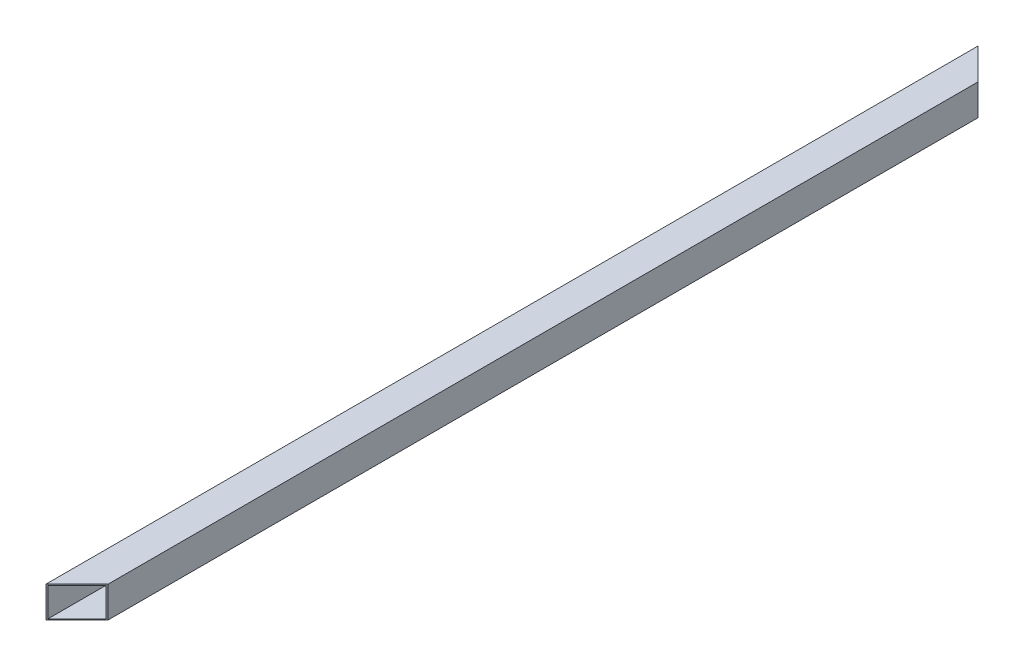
ISO-10303-21;
HEADER;
FILE_DESCRIPTION(('STEP AP214'),'2;1');
FILE_NAME('part.step','',(''),(''),'','','');
FILE_SCHEMA(('AUTOMOTIVE_DESIGN { 1 0 10303 214 1 1 1 1 }'));
ENDSEC;
DATA;
#1=APPLICATION_CONTEXT('core data for automotive mechanical design processes');
#2=APPLICATION_PROTOCOL_DEFINITION('international standard','automotive_design',2000,#1);
#3=PRODUCT_CONTEXT('',#1,'mechanical');
#4=PRODUCT('Part','Part','',(#3));
#5=PRODUCT_RELATED_PRODUCT_CATEGORY('part','',(#4));
#6=PRODUCT_DEFINITION_FORMATION('','',#4);
#7=PRODUCT_DEFINITION_CONTEXT('part definition',#1,'design');
#8=PRODUCT_DEFINITION('design','',#6,#7);
#9=PRODUCT_DEFINITION_SHAPE('','',#8);
#10=(LENGTH_UNIT() NAMED_UNIT(*) SI_UNIT(.MILLI.,.METRE.));
#11=(NAMED_UNIT(*) PLANE_ANGLE_UNIT() SI_UNIT($,.RADIAN.));
#12=(NAMED_UNIT(*) SI_UNIT($,.STERADIAN.) SOLID_ANGLE_UNIT());
#13=UNCERTAINTY_MEASURE_WITH_UNIT(LENGTH_MEASURE(1.E-05),#10,'distance_accuracy_value','');
#14=(GEOMETRIC_REPRESENTATION_CONTEXT(3) GLOBAL_UNCERTAINTY_ASSIGNED_CONTEXT((#13)) GLOBAL_UNIT_ASSIGNED_CONTEXT((#10,
#11,#12)) REPRESENTATION_CONTEXT('',''));
#15=CARTESIAN_POINT('',(0.,0.,0.));
#16=DIRECTION('',(0.,0.,1.));
#17=DIRECTION('',(1.,0.,0.));
#18=AXIS2_PLACEMENT_3D('',#15,#16,#17);
#19=CARTESIAN_POINT('',(15.0000000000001,-15.,900.000000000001));
#20=DIRECTION('',(-1.,0.,0.));
#21=DIRECTION('',(0.,0.,1.));
#22=AXIS2_PLACEMENT_3D('',#19,#20,#21);
#23=PLANE('',#22);
#24=DIRECTION('',(0.,1.,0.));
#25=VECTOR('',#24,1.);
#26=CARTESIAN_POINT('',(15.0000000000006,-15.001,870.000000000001));
#27=LINE('',#26,#25);
#28=CARTESIAN_POINT('',(15.0000000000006,-15.,870.000000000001));
#29=VERTEX_POINT('',#28);
#30=CARTESIAN_POINT('',(15.0000000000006,14.9999999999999,870.000000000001));
#31=VERTEX_POINT('',#30);
#32=EDGE_CURVE('E135',#29,#31,#27,.T.);
#33=ORIENTED_EDGE('',*,*,#32,.F.);
#34=DIRECTION('',(0.,0.,-1.));
#35=VECTOR('',#34,1.);
#36=CARTESIAN_POINT('',(15.0000000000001,-15.,900.000000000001));
#37=LINE('',#36,#35);
#38=CARTESIAN_POINT('',(15.0000000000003,-15.,29.9999999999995));
#39=VERTEX_POINT('',#38);
#40=EDGE_CURVE('E86',#29,#39,#37,.T.);
#41=ORIENTED_EDGE('',*,*,#40,.T.);
#42=DIRECTION('',(0.,1.,0.));
#43=VECTOR('',#42,1.);
#44=CARTESIAN_POINT('',(15.0000000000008,-15.0010000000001,29.9999999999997));
#45=LINE('',#44,#43);
#46=CARTESIAN_POINT('',(15.0000000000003,15.,29.9999999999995));
#47=VERTEX_POINT('',#46);
#48=EDGE_CURVE('E182',#39,#47,#45,.T.);
#49=ORIENTED_EDGE('',*,*,#48,.T.);
#50=DIRECTION('',(0.,0.,-1.));
#51=VECTOR('',#50,1.);
#52=CARTESIAN_POINT('',(15.0000000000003,14.9999999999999,900.));
#53=LINE('',#52,#51);
#54=EDGE_CURVE('E13',#31,#47,#53,.T.);
#55=ORIENTED_EDGE('',*,*,#54,.F.);
#56=EDGE_LOOP('',(#33,#41,#49,#55));
#57=FACE_BOUND('',#56,.T.);
#58=ADVANCED_FACE('F64',(#57),#23,.F.);
#59=CARTESIAN_POINT('',(-14.9999999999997,15.,900.));
#60=DIRECTION('',(0.,-1.,0.));
#61=DIRECTION('',(0.,0.,-1.));
#62=AXIS2_PLACEMENT_3D('',#59,#60,#61);
#63=PLANE('',#62);
#64=DIRECTION('',(0.707106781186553,0.,-0.707106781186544));
#65=VECTOR('',#64,1.);
#66=CARTESIAN_POINT('',(-14.9999999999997,15.,900.));
#67=LINE('',#66,#65);
#68=CARTESIAN_POINT('',(-14.9999999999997,15.,900.));
#69=VERTEX_POINT('',#68);
#70=EDGE_CURVE('E177',#69,#31,#67,.T.);
#71=ORIENTED_EDGE('',*,*,#70,.T.);
#72=ORIENTED_EDGE('',*,*,#54,.T.);
#73=DIRECTION('',(0.707106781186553,0.,0.707106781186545));
#74=VECTOR('',#73,1.);
#75=CARTESIAN_POINT('',(-14.9999999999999,14.9999999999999,-1.11022302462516E-13));
#76=LINE('',#75,#74);
#77=CARTESIAN_POINT('',(-14.9999999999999,14.9999999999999,-1.11022302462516E-13));
#78=VERTEX_POINT('',#77);
#79=EDGE_CURVE('E180',#78,#47,#76,.T.);
#80=ORIENTED_EDGE('',*,*,#79,.F.);
#81=DIRECTION('',(0.,0.,-1.));
#82=VECTOR('',#81,1.);
#83=CARTESIAN_POINT('',(-14.9999999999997,15.,900.));
#84=LINE('',#83,#82);
#85=EDGE_CURVE('E71',#69,#78,#84,.T.);
#86=ORIENTED_EDGE('',*,*,#85,.F.);
#87=EDGE_LOOP('',(#71,#72,#80,#86));
#88=FACE_BOUND('',#87,.T.);
#89=ADVANCED_FACE('F176',(#88),#63,.F.);
#90=CARTESIAN_POINT('',(-14.9999999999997,-15.0000000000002,900.));
#91=DIRECTION('',(0.,1.,0.));
#92=DIRECTION('',(0.,0.,1.));
#93=AXIS2_PLACEMENT_3D('',#90,#91,#92);
#94=PLANE('',#93);
#95=DIRECTION('',(-0.707106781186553,0.,0.707106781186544));
#96=VECTOR('',#95,1.);
#97=CARTESIAN_POINT('',(-14.9999999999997,-15.0000000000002,900.));
#98=LINE('',#97,#96);
#99=CARTESIAN_POINT('',(-14.9999999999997,-15.0000000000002,900.));
#100=VERTEX_POINT('',#99);
#101=EDGE_CURVE('E201',#29,#100,#98,.T.);
#102=ORIENTED_EDGE('',*,*,#101,.T.);
#103=DIRECTION('',(0.,0.,-1.));
#104=VECTOR('',#103,1.);
#105=CARTESIAN_POINT('',(-14.9999999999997,-15.0000000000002,900.));
#106=LINE('',#105,#104);
#107=CARTESIAN_POINT('',(-14.9999999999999,-14.9999999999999,-2.22044604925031E-13));
#108=VERTEX_POINT('',#107);
#109=EDGE_CURVE('E164',#100,#108,#106,.T.);
#110=ORIENTED_EDGE('',*,*,#109,.T.);
#111=DIRECTION('',(-0.707106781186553,0.,-0.707106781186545));
#112=VECTOR('',#111,1.);
#113=CARTESIAN_POINT('',(-14.9999999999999,-14.9999999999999,-2.22044604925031E-13));
#114=LINE('',#113,#112);
#115=EDGE_CURVE('E154',#39,#108,#114,.T.);
#116=ORIENTED_EDGE('',*,*,#115,.F.);
#117=ORIENTED_EDGE('',*,*,#40,.F.);
#118=EDGE_LOOP('',(#102,#110,#116,#117));
#119=FACE_BOUND('',#118,.T.);
#120=ADVANCED_FACE('F200',(#119),#94,.F.);
#121=CARTESIAN_POINT('',(14.0000000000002,-1.11022302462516E-13,900.));
#122=DIRECTION('',(-1.,0.,0.));
#123=DIRECTION('',(0.,0.,1.));
#124=AXIS2_PLACEMENT_3D('',#121,#122,#123);
#125=PLANE('',#124);
#126=DIRECTION('',(0.,0.,-1.));
#127=VECTOR('',#126,1.);
#128=CARTESIAN_POINT('',(14.0000000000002,-14.,900.));
#129=LINE('',#128,#127);
#130=CARTESIAN_POINT('',(14.0000000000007,-14.0000000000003,871.000000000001));
#131=VERTEX_POINT('',#130);
#132=CARTESIAN_POINT('',(14.,-14.0000000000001,28.9999999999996));
#133=VERTEX_POINT('',#132);
#134=EDGE_CURVE('E150',#131,#133,#129,.T.);
#135=ORIENTED_EDGE('',*,*,#134,.F.);
#136=DIRECTION('',(0.,-1.,0.));
#137=VECTOR('',#136,1.);
#138=CARTESIAN_POINT('',(14.0000000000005,-15.0010000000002,871.000000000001));
#139=LINE('',#138,#137);
#140=CARTESIAN_POINT('',(14.0000000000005,14.,871.000000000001));
#141=VERTEX_POINT('',#140);
#142=EDGE_CURVE('E78',#141,#131,#139,.T.);
#143=ORIENTED_EDGE('',*,*,#142,.F.);
#144=DIRECTION('',(0.,0.,-1.));
#145=VECTOR('',#144,1.);
#146=CARTESIAN_POINT('',(14.0000000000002,13.9999999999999,900.));
#147=LINE('',#146,#145);
#148=CARTESIAN_POINT('',(14.0000000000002,14.,28.9999999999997));
#149=VERTEX_POINT('',#148);
#150=EDGE_CURVE('E152',#141,#149,#147,.T.);
#151=ORIENTED_EDGE('',*,*,#150,.T.);
#152=DIRECTION('',(0.,-1.,0.));
#153=VECTOR('',#152,1.);
#154=CARTESIAN_POINT('',(13.9999999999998,-15.0010000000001,28.9999999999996));
#155=LINE('',#154,#153);
#156=EDGE_CURVE('E194',#149,#133,#155,.T.);
#157=ORIENTED_EDGE('',*,*,#156,.T.);
#158=EDGE_LOOP('',(#135,#143,#151,#157));
#159=FACE_BOUND('',#158,.T.);
#160=ADVANCED_FACE('F208',(#159),#125,.T.);
#161=CARTESIAN_POINT('',(2.22044604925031E-13,13.9999999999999,900.));
#162=DIRECTION('',(0.,-1.,0.));
#163=DIRECTION('',(0.,0.,-1.));
#164=AXIS2_PLACEMENT_3D('',#161,#162,#163);
#165=PLANE('',#164);
#166=ORIENTED_EDGE('',*,*,#150,.F.);
#167=DIRECTION('',(0.707106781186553,0.,-0.707106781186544));
#168=VECTOR('',#167,1.);
#169=CARTESIAN_POINT('',(-14.9999999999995,13.9999999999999,900.));
#170=LINE('',#169,#168);
#171=CARTESIAN_POINT('',(-13.9999999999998,13.9999999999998,899.000000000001));
#172=VERTEX_POINT('',#171);
#173=EDGE_CURVE('E144',#172,#141,#170,.T.);
#174=ORIENTED_EDGE('',*,*,#173,.F.);
#175=DIRECTION('',(0.,0.,-1.));
#176=VECTOR('',#175,1.);
#177=CARTESIAN_POINT('',(-14.,14.,900.));
#178=LINE('',#177,#176);
#179=CARTESIAN_POINT('',(-13.9999999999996,13.9999999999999,0.999999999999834));
#180=VERTEX_POINT('',#179);
#181=EDGE_CURVE('E143',#172,#180,#178,.T.);
#182=ORIENTED_EDGE('',*,*,#181,.T.);
#183=DIRECTION('',(0.707106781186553,0.,0.707106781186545));
#184=VECTOR('',#183,1.);
#185=CARTESIAN_POINT('',(-14.9999999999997,13.9999999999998,-3.33066907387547E-13));
#186=LINE('',#185,#184);
#187=EDGE_CURVE('E191',#180,#149,#186,.T.);
#188=ORIENTED_EDGE('',*,*,#187,.T.);
#189=EDGE_LOOP('',(#166,#174,#182,#188));
#190=FACE_BOUND('',#189,.T.);
#191=ADVANCED_FACE('F210',(#190),#165,.T.);
#192=CARTESIAN_POINT('',(-13.9999999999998,0.,900.));
#193=DIRECTION('',(1.,0.,0.));
#194=DIRECTION('',(0.,0.,-1.));
#195=AXIS2_PLACEMENT_3D('',#192,#193,#194);
#196=PLANE('',#195);
#197=ORIENTED_EDGE('',*,*,#181,.F.);
#198=DIRECTION('',(0.,1.,0.));
#199=VECTOR('',#198,1.);
#200=CARTESIAN_POINT('',(-13.9999999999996,-15.0010000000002,899.000000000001));
#201=LINE('',#200,#199);
#202=CARTESIAN_POINT('',(-13.9999999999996,-14.,899.000000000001));
#203=VERTEX_POINT('',#202);
#204=EDGE_CURVE('E130',#203,#172,#201,.T.);
#205=ORIENTED_EDGE('',*,*,#204,.F.);
#206=DIRECTION('',(0.,0.,-1.));
#207=VECTOR('',#206,1.);
#208=CARTESIAN_POINT('',(-14.,-14.,900.000000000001));
#209=LINE('',#208,#207);
#210=CARTESIAN_POINT('',(-13.9999999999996,-14.0000000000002,1.00000000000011));
#211=VERTEX_POINT('',#210);
#212=EDGE_CURVE('E141',#203,#211,#209,.T.);
#213=ORIENTED_EDGE('',*,*,#212,.T.);
#214=DIRECTION('',(0.,1.,0.));
#215=VECTOR('',#214,1.);
#216=CARTESIAN_POINT('',(-13.9999999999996,-15.001,0.99999999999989));
#217=LINE('',#216,#215);
#218=EDGE_CURVE('E189',#211,#180,#217,.T.);
#219=ORIENTED_EDGE('',*,*,#218,.T.);
#220=EDGE_LOOP('',(#197,#205,#213,#219));
#221=FACE_BOUND('',#220,.T.);
#222=ADVANCED_FACE('F139',(#221),#196,.T.);
#223=CARTESIAN_POINT('',(4.44089209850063E-13,-14.0000000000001,900.));
#224=DIRECTION('',(0.,1.,0.));
#225=DIRECTION('',(0.,0.,1.));
#226=AXIS2_PLACEMENT_3D('',#223,#224,#225);
#227=PLANE('',#226);
#228=ORIENTED_EDGE('',*,*,#212,.F.);
#229=DIRECTION('',(-0.707106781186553,0.,0.707106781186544));
#230=VECTOR('',#229,1.);
#231=CARTESIAN_POINT('',(-14.9999999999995,-14.0000000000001,900.));
#232=LINE('',#231,#230);
#233=EDGE_CURVE('E126',#131,#203,#232,.T.);
#234=ORIENTED_EDGE('',*,*,#233,.F.);
#235=ORIENTED_EDGE('',*,*,#134,.T.);
#236=DIRECTION('',(-0.707106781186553,0.,-0.707106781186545));
#237=VECTOR('',#236,1.);
#238=CARTESIAN_POINT('',(-14.9999999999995,-14.,-1.11022302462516E-13));
#239=LINE('',#238,#237);
#240=EDGE_CURVE('E149',#133,#211,#239,.T.);
#241=ORIENTED_EDGE('',*,*,#240,.T.);
#242=EDGE_LOOP('',(#228,#234,#235,#241));
#243=FACE_BOUND('',#242,.T.);
#244=ADVANCED_FACE('F147',(#243),#227,.T.);
#245=CARTESIAN_POINT('',(-14.9999999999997,-15.0000000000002,900.));
#246=DIRECTION('',(1.,0.,0.));
#247=DIRECTION('',(0.,0.,-1.));
#248=AXIS2_PLACEMENT_3D('',#245,#246,#247);
#249=PLANE('',#248);
#250=DIRECTION('',(0.,-1.,0.));
#251=VECTOR('',#250,1.);
#252=CARTESIAN_POINT('',(-14.9999999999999,-14.9999999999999,-2.22044604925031E-13));
#253=LINE('',#252,#251);
#254=EDGE_CURVE('E159',#78,#108,#253,.T.);
#255=ORIENTED_EDGE('',*,*,#254,.T.);
#256=ORIENTED_EDGE('',*,*,#109,.F.);
#257=DIRECTION('',(0.,-1.,0.));
#258=VECTOR('',#257,1.);
#259=CARTESIAN_POINT('',(-14.9999999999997,-15.0000000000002,900.));
#260=LINE('',#259,#258);
#261=EDGE_CURVE('E160',#69,#100,#260,.T.);
#262=ORIENTED_EDGE('',*,*,#261,.F.);
#263=ORIENTED_EDGE('',*,*,#85,.T.);
#264=EDGE_LOOP('',(#255,#256,#262,#263));
#265=FACE_BOUND('',#264,.T.);
#266=ADVANCED_FACE('F171',(#265),#249,.F.);
#267=CARTESIAN_POINT('',(-14.9999999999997,-15.001,-1.11022302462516E-13));
#268=DIRECTION('',(-0.707106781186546,0.,0.707106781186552));
#269=DIRECTION('',(0.707106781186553,0.,0.707106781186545));
#270=AXIS2_PLACEMENT_3D('',#267,#268,#269);
#271=PLANE('',#270);
#272=ORIENTED_EDGE('',*,*,#187,.F.);
#273=ORIENTED_EDGE('',*,*,#218,.F.);
#274=ORIENTED_EDGE('',*,*,#240,.F.);
#275=ORIENTED_EDGE('',*,*,#156,.F.);
#276=EDGE_LOOP('',(#272,#273,#274,#275));
#277=FACE_BOUND('',#276,.T.);
#278=ORIENTED_EDGE('',*,*,#115,.T.);
#279=ORIENTED_EDGE('',*,*,#254,.F.);
#280=ORIENTED_EDGE('',*,*,#79,.T.);
#281=ORIENTED_EDGE('',*,*,#48,.F.);
#282=EDGE_LOOP('',(#278,#279,#280,#281));
#283=FACE_BOUND('',#282,.T.);
#284=ADVANCED_FACE('F197',(#277,#283),#271,.F.);
#285=CARTESIAN_POINT('',(-14.9999999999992,-15.0010000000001,900.));
#286=DIRECTION('',(0.707106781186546,0.,0.707106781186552));
#287=DIRECTION('',(0.707106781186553,0.,-0.707106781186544));
#288=AXIS2_PLACEMENT_3D('',#285,#286,#287);
#289=PLANE('',#288);
#290=ORIENTED_EDGE('',*,*,#142,.T.);
#291=ORIENTED_EDGE('',*,*,#233,.T.);
#292=ORIENTED_EDGE('',*,*,#204,.T.);
#293=ORIENTED_EDGE('',*,*,#173,.T.);
#294=EDGE_LOOP('',(#290,#291,#292,#293));
#295=FACE_BOUND('',#294,.T.);
#296=ORIENTED_EDGE('',*,*,#32,.T.);
#297=ORIENTED_EDGE('',*,*,#70,.F.);
#298=ORIENTED_EDGE('',*,*,#261,.T.);
#299=ORIENTED_EDGE('',*,*,#101,.F.);
#300=EDGE_LOOP('',(#296,#297,#298,#299));
#301=FACE_BOUND('',#300,.T.);
#302=ADVANCED_FACE('F128',(#295,#301),#289,.T.);
#303=CLOSED_SHELL('',(#58,#89,#120,#160,#191,#222,#244,#266,#284,#302));
#304=MANIFOLD_SOLID_BREP('B2',#303);
#305=ADVANCED_BREP_SHAPE_REPRESENTATION('',(#18,#304),#14);
#306=SHAPE_DEFINITION_REPRESENTATION(#9,#305);
ENDSEC;
END-ISO-10303-21;
